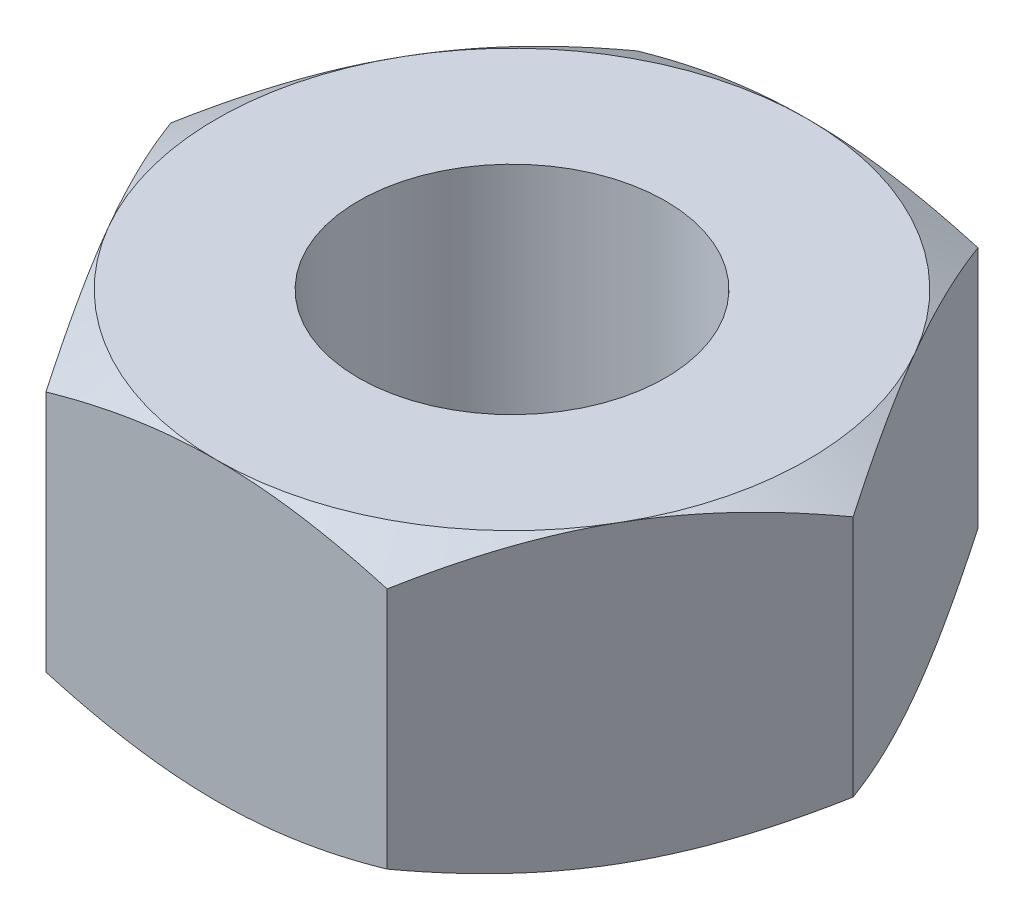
ISO-10303-21;
HEADER;
FILE_DESCRIPTION(('STEP AP214'),'2;1');
FILE_NAME('part.step','',(''),(''),'','','');
FILE_SCHEMA(('AUTOMOTIVE_DESIGN { 1 0 10303 214 1 1 1 1 }'));
ENDSEC;
DATA;
#1=APPLICATION_CONTEXT('core data for automotive mechanical design processes');
#2=APPLICATION_PROTOCOL_DEFINITION('international standard','automotive_design',2000,#1);
#3=PRODUCT_CONTEXT('',#1,'mechanical');
#4=PRODUCT('Part','Part','',(#3));
#5=PRODUCT_RELATED_PRODUCT_CATEGORY('part','',(#4));
#6=PRODUCT_DEFINITION_FORMATION('','',#4);
#7=PRODUCT_DEFINITION_CONTEXT('part definition',#1,'design');
#8=PRODUCT_DEFINITION('design','',#6,#7);
#9=PRODUCT_DEFINITION_SHAPE('','',#8);
#10=(LENGTH_UNIT() NAMED_UNIT(*) SI_UNIT(.MILLI.,.METRE.));
#11=(NAMED_UNIT(*) PLANE_ANGLE_UNIT() SI_UNIT($,.RADIAN.));
#12=(NAMED_UNIT(*) SI_UNIT($,.STERADIAN.) SOLID_ANGLE_UNIT());
#13=UNCERTAINTY_MEASURE_WITH_UNIT(LENGTH_MEASURE(1.E-05),#10,'distance_accuracy_value','');
#14=(GEOMETRIC_REPRESENTATION_CONTEXT(3) GLOBAL_UNCERTAINTY_ASSIGNED_CONTEXT((#13)) GLOBAL_UNIT_ASSIGNED_CONTEXT((#10,
#11,#12)) REPRESENTATION_CONTEXT('',''));
#15=CARTESIAN_POINT('',(0.,0.,0.));
#16=DIRECTION('',(0.,0.,1.));
#17=DIRECTION('',(1.,0.,0.));
#18=AXIS2_PLACEMENT_3D('',#15,#16,#17);
#19=CARTESIAN_POINT('',(3.75277674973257,3.25,6.5));
#20=DIRECTION('',(-0.866025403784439,0.,-0.5));
#21=DIRECTION('',(-0.5,0.,0.866025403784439));
#22=AXIS2_PLACEMENT_3D('',#19,#20,#21);
#23=PLANE('',#22);
#24=CARTESIAN_POINT('',(7.50566896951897,-2.66937674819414,-0.000200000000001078));
#25=CARTESIAN_POINT('',(7.4231786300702,-2.71699557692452,0.142677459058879));
#26=CARTESIAN_POINT('',(7.34038072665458,-2.7624532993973,0.286087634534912));
#27=CARTESIAN_POINT('',(7.17411251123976,-2.84845131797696,0.574072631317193));
#28=CARTESIAN_POINT('',(7.09064192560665,-2.88898949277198,0.718647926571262));
#29=CARTESIAN_POINT('',(6.83889369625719,-3.00242899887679,1.15468865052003));
#30=CARTESIAN_POINT('',(6.66962231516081,-3.06695219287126,1.44787528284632));
#31=CARTESIAN_POINT('',(6.41631077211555,-3.14261341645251,1.88662374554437));
#32=CARTESIAN_POINT('',(6.33302748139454,-3.16416714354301,2.03087463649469));
#33=CARTESIAN_POINT('',(6.16608458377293,-3.20030968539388,2.32002821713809));
#34=CARTESIAN_POINT('',(6.08242501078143,-3.21489911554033,2.46493084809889));
#35=CARTESIAN_POINT('',(5.91496056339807,-3.23674124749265,2.75498777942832));
#36=CARTESIAN_POINT('',(5.8311559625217,-3.24400227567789,2.90014160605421));
#37=CARTESIAN_POINT('',(5.66347396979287,-3.25103969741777,3.19057533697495));
#38=CARTESIAN_POINT('',(5.5795965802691,-3.25081632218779,3.33585523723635));
#39=CARTESIAN_POINT('',(5.34979921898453,-3.23991654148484,3.73387594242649));
#40=CARTESIAN_POINT('',(5.20395446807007,-3.22161818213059,3.98648646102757));
#41=CARTESIAN_POINT('',(4.91323365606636,-3.16359365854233,4.49002967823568));
#42=CARTESIAN_POINT('',(4.76835861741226,-3.12384766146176,4.74096060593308));
#43=CARTESIAN_POINT('',(4.47705272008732,-3.02449409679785,5.24551722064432));
#44=CARTESIAN_POINT('',(4.33065861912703,-2.96446557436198,5.49907924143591));
#45=CARTESIAN_POINT('',(4.04005357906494,-2.82822500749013,6.00242193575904));
#46=CARTESIAN_POINT('',(3.89583891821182,-2.75204496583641,6.25220905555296));
#47=CARTESIAN_POINT('',(3.75266127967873,-2.66937674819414,6.5002));
#48=B_SPLINE_CURVE_WITH_KNOTS('',3,(#24,#25,#26,#27,#28,#29,#30,#31,#32,#33,#34,#35,#36,#37,#38,
#39,#40,#41,#42,#43,#44,#45,#46,#47),.UNSPECIFIED.,.F.,.F.,(4,2,2,2,2,2,2,2,2,2,2,4),(0.,
0.515105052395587,1.03043143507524,2.06322554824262,2.56697389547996,3.07067772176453,
3.57380860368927,4.0769239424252,4.9527935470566,5.82947446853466,6.72559912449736,
7.61996451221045),.UNSPECIFIED.);
#49=CARTESIAN_POINT('',(7.50555349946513,-2.66944341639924,0.));
#50=VERTEX_POINT('',#49);
#51=CARTESIAN_POINT('',(5.62916512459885,-3.25,3.25));
#52=VERTEX_POINT('',#51);
#53=EDGE_CURVE('E47',#50,#52,#48,.T.);
#54=ORIENTED_EDGE('',*,*,#53,.F.);
#55=DIRECTION('',(0.,-1.,0.));
#56=VECTOR('',#55,1.);
#57=CARTESIAN_POINT('',(7.50555349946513,3.25,0.));
#58=LINE('',#57,#56);
#59=CARTESIAN_POINT('',(7.50555349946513,2.66944341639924,0.));
#60=VERTEX_POINT('',#59);
#61=EDGE_CURVE('E163',#60,#50,#58,.T.);
#62=ORIENTED_EDGE('',*,*,#61,.F.);
#63=CARTESIAN_POINT('',(3.75266127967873,2.66937674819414,6.5002));
#64=CARTESIAN_POINT('',(3.8351516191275,2.71699557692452,6.35732254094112));
#65=CARTESIAN_POINT('',(3.91794952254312,2.7624532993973,6.21391236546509));
#66=CARTESIAN_POINT('',(4.08421773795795,2.84845131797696,5.92592736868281));
#67=CARTESIAN_POINT('',(4.16768832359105,2.88898949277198,5.78135207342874));
#68=CARTESIAN_POINT('',(4.41943655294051,3.00242899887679,5.34531134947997));
#69=CARTESIAN_POINT('',(4.58870793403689,3.06695219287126,5.05212471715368));
#70=CARTESIAN_POINT('',(4.84201947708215,3.14261341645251,4.61337625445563));
#71=CARTESIAN_POINT('',(4.92530276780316,3.16416714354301,4.46912536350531));
#72=CARTESIAN_POINT('',(5.09224566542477,3.20030968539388,4.17997178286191));
#73=CARTESIAN_POINT('',(5.17590523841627,3.21489911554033,4.03506915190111));
#74=CARTESIAN_POINT('',(5.34336968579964,3.23674124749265,3.74501222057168));
#75=CARTESIAN_POINT('',(5.427174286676,3.24400227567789,3.59985839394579));
#76=CARTESIAN_POINT('',(5.59485627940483,3.25103969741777,3.30942466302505));
#77=CARTESIAN_POINT('',(5.6787336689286,3.25081632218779,3.16414476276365));
#78=CARTESIAN_POINT('',(5.90853103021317,3.23991654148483,2.76612405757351));
#79=CARTESIAN_POINT('',(6.05437578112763,3.22161818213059,2.51351353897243));
#80=CARTESIAN_POINT('',(6.34509659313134,3.16359365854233,2.00997032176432));
#81=CARTESIAN_POINT('',(6.48997163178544,3.12384766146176,1.75903939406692));
#82=CARTESIAN_POINT('',(6.78127752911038,3.02449409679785,1.25448277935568));
#83=CARTESIAN_POINT('',(6.92767163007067,2.96446557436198,1.00092075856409));
#84=CARTESIAN_POINT('',(7.21827667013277,2.82822500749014,0.497578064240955));
#85=CARTESIAN_POINT('',(7.36249133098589,2.75204496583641,0.247790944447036));
#86=CARTESIAN_POINT('',(7.50566896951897,2.66937674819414,-0.000200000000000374));
#87=B_SPLINE_CURVE_WITH_KNOTS('',3,(#63,#64,#65,#66,#67,#68,#69,#70,#71,#72,#73,#74,#75,#76,#77,
#78,#79,#80,#81,#82,#83,#84,#85,#86),.UNSPECIFIED.,.F.,.F.,(4,2,2,2,2,2,2,2,2,2,2,4),(0.,
0.515105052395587,1.03043143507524,2.06322554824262,2.56697389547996,3.07067772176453,
3.57380860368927,4.07692394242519,4.9527935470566,5.82947446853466,6.72559912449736,
7.61996451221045),.UNSPECIFIED.);
#88=CARTESIAN_POINT('',(5.62916512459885,3.25,3.25));
#89=VERTEX_POINT('',#88);
#90=EDGE_CURVE('E246',#89,#60,#87,.T.);
#91=ORIENTED_EDGE('',*,*,#90,.F.);
#92=CARTESIAN_POINT('',(3.75277674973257,2.66944341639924,6.5));
#93=VERTEX_POINT('',#92);
#94=EDGE_CURVE('E256',#93,#89,#87,.T.);
#95=ORIENTED_EDGE('',*,*,#94,.F.);
#96=DIRECTION('',(0.,-1.,0.));
#97=VECTOR('',#96,1.);
#98=CARTESIAN_POINT('',(3.75277674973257,3.25,6.5));
#99=LINE('',#98,#97);
#100=CARTESIAN_POINT('',(3.75277674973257,-2.66944341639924,6.5));
#101=VERTEX_POINT('',#100);
#102=EDGE_CURVE('E150',#93,#101,#99,.T.);
#103=ORIENTED_EDGE('',*,*,#102,.T.);
#104=EDGE_CURVE('E142',#52,#101,#48,.T.);
#105=ORIENTED_EDGE('',*,*,#104,.F.);
#106=EDGE_LOOP('',(#54,#62,#91,#95,#103,#105));
#107=FACE_BOUND('',#106,.T.);
#108=ADVANCED_FACE('F31',(#107),#23,.F.);
#109=CARTESIAN_POINT('',(7.50555349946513,3.25,0.));
#110=DIRECTION('',(-0.866025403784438,0.,0.5));
#111=DIRECTION('',(0.5,0.,0.866025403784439));
#112=AXIS2_PLACEMENT_3D('',#109,#110,#111);
#113=PLANE('',#112);
#114=CARTESIAN_POINT('',(3.75266127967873,-2.66937674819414,-6.5002));
#115=CARTESIAN_POINT('',(3.8351516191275,-2.71699557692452,-6.35732254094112));
#116=CARTESIAN_POINT('',(3.91794952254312,-2.7624532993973,-6.21391236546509));
#117=CARTESIAN_POINT('',(4.08421773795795,-2.84845131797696,-5.9259273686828));
#118=CARTESIAN_POINT('',(4.16768832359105,-2.88898949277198,-5.78135207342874));
#119=CARTESIAN_POINT('',(4.41943655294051,-3.00242899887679,-5.34531134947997));
#120=CARTESIAN_POINT('',(4.58870793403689,-3.06695219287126,-5.05212471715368));
#121=CARTESIAN_POINT('',(4.84201947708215,-3.14261341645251,-4.61337625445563));
#122=CARTESIAN_POINT('',(4.92530276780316,-3.16416714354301,-4.46912536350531));
#123=CARTESIAN_POINT('',(5.09224566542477,-3.20030968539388,-4.17997178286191));
#124=CARTESIAN_POINT('',(5.17590523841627,-3.21489911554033,-4.03506915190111));
#125=CARTESIAN_POINT('',(5.34336968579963,-3.23674124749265,-3.74501222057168));
#126=CARTESIAN_POINT('',(5.427174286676,-3.24400227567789,-3.59985839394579));
#127=CARTESIAN_POINT('',(5.59485627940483,-3.25103969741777,-3.30942466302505));
#128=CARTESIAN_POINT('',(5.6787336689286,-3.2508163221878,-3.16414476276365));
#129=CARTESIAN_POINT('',(5.90853103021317,-3.23991654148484,-2.76612405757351));
#130=CARTESIAN_POINT('',(6.05437578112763,-3.22161818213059,-2.51351353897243));
#131=CARTESIAN_POINT('',(6.34509659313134,-3.16359365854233,-2.00997032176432));
#132=CARTESIAN_POINT('',(6.48997163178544,-3.12384766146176,-1.75903939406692));
#133=CARTESIAN_POINT('',(6.78127752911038,-3.02449409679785,-1.25448277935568));
#134=CARTESIAN_POINT('',(6.92767163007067,-2.96446557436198,-1.00092075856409));
#135=CARTESIAN_POINT('',(7.21827667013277,-2.82822500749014,-0.497578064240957));
#136=CARTESIAN_POINT('',(7.36249133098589,-2.75204496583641,-0.247790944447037));
#137=CARTESIAN_POINT('',(7.50566896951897,-2.66937674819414,0.000199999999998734));
#138=B_SPLINE_CURVE_WITH_KNOTS('',3,(#114,#115,#116,#117,#118,#119,#120,#121,#122,#123,#124,
#125,#126,#127,#128,#129,#130,#131,#132,#133,#134,#135,#136,#137),.UNSPECIFIED.,.F.,.F.,(4,2,2,
2,2,2,2,2,2,2,2,4),(0.,0.515105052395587,1.03043143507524,2.06322554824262,2.56697389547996,
3.07067772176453,3.57380860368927,4.07692394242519,4.9527935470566,5.82947446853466,
6.72559912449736,7.61996451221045),.UNSPECIFIED.);
#139=CARTESIAN_POINT('',(3.75277674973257,-2.66944341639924,-6.5));
#140=VERTEX_POINT('',#139);
#141=CARTESIAN_POINT('',(5.62916512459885,-3.25,-3.25));
#142=VERTEX_POINT('',#141);
#143=EDGE_CURVE('E54',#140,#142,#138,.T.);
#144=ORIENTED_EDGE('',*,*,#143,.F.);
#145=DIRECTION('',(0.,-1.,0.));
#146=VECTOR('',#145,1.);
#147=CARTESIAN_POINT('',(3.75277674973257,3.25,-6.5));
#148=LINE('',#147,#146);
#149=CARTESIAN_POINT('',(3.75277674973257,2.66944341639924,-6.5));
#150=VERTEX_POINT('',#149);
#151=EDGE_CURVE('E160',#150,#140,#148,.T.);
#152=ORIENTED_EDGE('',*,*,#151,.F.);
#153=CARTESIAN_POINT('',(7.50566896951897,2.66937674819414,0.000199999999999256));
#154=CARTESIAN_POINT('',(7.4231786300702,2.71699557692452,-0.142677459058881));
#155=CARTESIAN_POINT('',(7.34038072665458,2.7624532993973,-0.286087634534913));
#156=CARTESIAN_POINT('',(7.17411251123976,2.84845131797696,-0.574072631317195));
#157=CARTESIAN_POINT('',(7.09064192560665,2.88898949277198,-0.718647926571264));
#158=CARTESIAN_POINT('',(6.83889369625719,3.00242899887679,-1.15468865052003));
#159=CARTESIAN_POINT('',(6.66962231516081,3.06695219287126,-1.44787528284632));
#160=CARTESIAN_POINT('',(6.41631077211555,3.14261341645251,-1.88662374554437));
#161=CARTESIAN_POINT('',(6.33302748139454,3.16416714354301,-2.03087463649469));
#162=CARTESIAN_POINT('',(6.16608458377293,3.20030968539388,-2.32002821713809));
#163=CARTESIAN_POINT('',(6.08242501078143,3.21489911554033,-2.46493084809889));
#164=CARTESIAN_POINT('',(5.91496056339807,3.23674124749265,-2.75498777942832));
#165=CARTESIAN_POINT('',(5.8311559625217,3.24400227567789,-2.90014160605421));
#166=CARTESIAN_POINT('',(5.66347396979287,3.25103969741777,-3.19057533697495));
#167=CARTESIAN_POINT('',(5.5795965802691,3.25081632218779,-3.33585523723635));
#168=CARTESIAN_POINT('',(5.34979921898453,3.23991654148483,-3.73387594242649));
#169=CARTESIAN_POINT('',(5.20395446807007,3.22161818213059,-3.98648646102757));
#170=CARTESIAN_POINT('',(4.91323365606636,3.16359365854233,-4.49002967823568));
#171=CARTESIAN_POINT('',(4.76835861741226,3.12384766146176,-4.74096060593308));
#172=CARTESIAN_POINT('',(4.47705272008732,3.02449409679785,-5.24551722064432));
#173=CARTESIAN_POINT('',(4.33065861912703,2.96446557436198,-5.49907924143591));
#174=CARTESIAN_POINT('',(4.04005357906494,2.82822500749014,-6.00242193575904));
#175=CARTESIAN_POINT('',(3.89583891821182,2.75204496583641,-6.25220905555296));
#176=CARTESIAN_POINT('',(3.75266127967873,2.66937674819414,-6.5002));
#177=B_SPLINE_CURVE_WITH_KNOTS('',3,(#153,#154,#155,#156,#157,#158,#159,#160,#161,#162,#163,
#164,#165,#166,#167,#168,#169,#170,#171,#172,#173,#174,#175,#176),.UNSPECIFIED.,.F.,.F.,(4,2,2,
2,2,2,2,2,2,2,2,4),(0.,0.515105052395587,1.03043143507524,2.06322554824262,2.56697389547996,
3.07067772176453,3.57380860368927,4.07692394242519,4.9527935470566,5.82947446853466,
6.72559912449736,7.61996451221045),.UNSPECIFIED.);
#178=CARTESIAN_POINT('',(5.62916512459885,3.25,-3.25));
#179=VERTEX_POINT('',#178);
#180=EDGE_CURVE('E255',#179,#150,#177,.T.);
#181=ORIENTED_EDGE('',*,*,#180,.F.);
#182=EDGE_CURVE('E251',#60,#179,#177,.T.);
#183=ORIENTED_EDGE('',*,*,#182,.F.);
#184=ORIENTED_EDGE('',*,*,#61,.T.);
#185=EDGE_CURVE('E268',#142,#50,#138,.T.);
#186=ORIENTED_EDGE('',*,*,#185,.F.);
#187=EDGE_LOOP('',(#144,#152,#181,#183,#184,#186));
#188=FACE_BOUND('',#187,.T.);
#189=ADVANCED_FACE('F257',(#188),#113,.F.);
#190=CARTESIAN_POINT('',(3.75277674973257,3.25,-6.5));
#191=DIRECTION('',(0.,0.,1.));
#192=DIRECTION('',(1.,0.,0.));
#193=AXIS2_PLACEMENT_3D('',#190,#191,#192);
#194=PLANE('',#193);
#195=CARTESIAN_POINT('',(-10.1135208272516,-0.0617560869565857,-6.5));
#196=CARTESIAN_POINT('',(-9.82935034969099,-0.199737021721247,-6.5));
#197=CARTESIAN_POINT('',(-9.54453109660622,-0.336404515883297,-6.5));
#198=CARTESIAN_POINT('',(-8.97325017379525,-0.606374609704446,-6.5));
#199=CARTESIAN_POINT('',(-8.68678825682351,-0.739676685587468,-6.5));
#200=CARTESIAN_POINT('',(-8.11041696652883,-1.00284152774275,-6.5));
#201=CARTESIAN_POINT('',(-7.82049733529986,-1.13268190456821,-6.5));
#202=CARTESIAN_POINT('',(-7.23836377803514,-1.3870934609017,-6.5));
#203=CARTESIAN_POINT('',(-6.94614996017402,-1.51166488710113,-6.5));
#204=CARTESIAN_POINT('',(-6.34939053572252,-1.75810187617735,-6.5));
#205=CARTESIAN_POINT('',(-6.0447533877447,-1.87974696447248,-6.5));
#206=CARTESIAN_POINT('',(-5.43192693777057,-2.11391042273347,-6.5));
#207=CARTESIAN_POINT('',(-5.12373724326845,-2.22642777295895,-6.5));
#208=CARTESIAN_POINT('',(-4.5038828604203,-2.43940644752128,-6.5));
#209=CARTESIAN_POINT('',(-4.1922265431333,-2.53989189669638,-6.5));
#210=CARTESIAN_POINT('',(-3.56443984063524,-2.72560299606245,-6.5));
#211=CARTESIAN_POINT('',(-3.24831088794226,-2.81083341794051,-6.5));
#212=CARTESIAN_POINT('',(-2.61318438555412,-2.96151245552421,-6.5));
#213=CARTESIAN_POINT('',(-2.29421310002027,-3.02707001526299,-6.5));
#214=CARTESIAN_POINT('',(-1.6522238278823,-3.13470964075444,-6.5));
#215=CARTESIAN_POINT('',(-1.32920623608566,-3.17679397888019,-6.5));
#216=CARTESIAN_POINT('',(-0.845079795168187,-3.21952256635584,-6.5));
#217=CARTESIAN_POINT('',(-0.684830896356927,-3.23035981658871,-6.5));
#218=CARTESIAN_POINT('',(-0.364011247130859,-3.24525189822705,-6.5));
#219=CARTESIAN_POINT('',(-0.20344050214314,-3.24930684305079,-6.5));
#220=CARTESIAN_POINT('',(0.117726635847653,-3.25053001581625,-6.5));
#221=CARTESIAN_POINT('',(0.278323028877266,-3.24769823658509,-6.5));
#222=CARTESIAN_POINT('',(0.599253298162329,-3.23521963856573,-6.5));
#223=CARTESIAN_POINT('',(0.759587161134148,-3.22557248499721,-6.5));
#224=CARTESIAN_POINT('',(1.14392607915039,-3.19448274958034,-6.5));
#225=CARTESIAN_POINT('',(1.36767946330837,-3.16986134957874,-6.5));
#226=CARTESIAN_POINT('',(1.81353669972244,-3.1086803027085,-6.5));
#227=CARTESIAN_POINT('',(2.03564032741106,-3.07211905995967,-6.5));
#228=CARTESIAN_POINT('',(2.69921711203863,-2.94646317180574,-6.5));
#229=CARTESIAN_POINT('',(3.13771059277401,-2.84141887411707,-6.5));
#230=CARTESIAN_POINT('',(3.79339853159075,-2.65912052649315,-6.5));
#231=CARTESIAN_POINT('',(4.01399055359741,-2.59338257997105,-6.5));
#232=CARTESIAN_POINT('',(4.45303253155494,-2.45504191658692,-6.5));
#233=CARTESIAN_POINT('',(4.67148247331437,-2.38243915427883,-6.5));
#234=CARTESIAN_POINT('',(5.10630803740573,-2.23153678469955,-6.5));
#235=CARTESIAN_POINT('',(5.32268430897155,-2.15323903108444,-6.5));
#236=CARTESIAN_POINT('',(5.75364187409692,-1.9918715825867,-6.5));
#237=CARTESIAN_POINT('',(5.96822318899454,-1.90880194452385,-6.5));
#238=CARTESIAN_POINT('',(6.47567680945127,-1.70689655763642,-6.5));
#239=CARTESIAN_POINT('',(6.76784492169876,-1.58629419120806,-6.5));
#240=CARTESIAN_POINT('',(7.349678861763,-1.3391799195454,-6.5));
#241=CARTESIAN_POINT('',(7.63934453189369,-1.21266764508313,-6.5));
#242=CARTESIAN_POINT('',(8.21663477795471,-0.954923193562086,-6.5));
#243=CARTESIAN_POINT('',(8.50425891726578,-0.823690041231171,-6.5));
#244=CARTESIAN_POINT('',(9.07775904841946,-0.557451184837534,-6.5));
#245=CARTESIAN_POINT('',(9.36363500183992,-0.422445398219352,-6.5));
#246=CARTESIAN_POINT('',(9.93423055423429,-0.149225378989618,-6.5));
#247=CARTESIAN_POINT('',(10.2189485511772,-0.0110078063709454,-6.5));
#248=CARTESIAN_POINT('',(10.7871485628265,0.267947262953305,-6.5));
#249=CARTESIAN_POINT('',(11.0706305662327,0.408684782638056,-6.5));
#250=CARTESIAN_POINT('',(11.9194411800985,0.833966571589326,-6.5));
#251=CARTESIAN_POINT('',(12.4832128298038,1.12161794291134,-6.5));
#252=CARTESIAN_POINT('',(13.5602729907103,1.67821105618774,-6.5));
#253=CARTESIAN_POINT('',(14.0738056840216,1.94668241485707,-6.5));
#254=CARTESIAN_POINT('',(15.0989534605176,2.48730381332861,-6.5));
#255=CARTESIAN_POINT('',(15.6105684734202,2.75945398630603,-6.5));
#256=CARTESIAN_POINT('',(16.6310038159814,3.30585849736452,-6.5));
#257=CARTESIAN_POINT('',(17.1398279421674,3.58010575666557,-6.5));
#258=CARTESIAN_POINT('',(18.1562506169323,4.13079503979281,-6.5));
#259=CARTESIAN_POINT('',(18.6638492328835,4.40723693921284,-6.5));
#260=CARTESIAN_POINT('',(19.1709972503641,4.6844974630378,-6.5));
#261=B_SPLINE_CURVE_WITH_KNOTS('',3,(#195,#196,#197,#198,#199,#200,#201,#202,#203,#204,#205,
#206,#207,#208,#209,#210,#211,#212,#213,#214,#215,#216,#217,#218,#219,#220,#221,#222,#223,#224,
#225,#226,#227,#228,#229,#230,#231,#232,#233,#234,#235,#236,#237,#238,#239,#240,#241,#242,#243,
#244,#245,#246,#247,#248,#249,#250,#251,#252,#253,#254,#255,#256,#257,#258,#259,#260),
.UNSPECIFIED.,.F.,.F.,(4,2,2,2,2,2,2,2,2,2,2,2,2,2,2,2,2,2,2,2,2,2,2,2,2,2,2,2,2,2,2,2,4),(0.,
0.947705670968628,1.89555793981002,2.84851502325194,3.80142743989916,4.78539370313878,
5.76946974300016,6.75153836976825,7.73329927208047,8.70951856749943,9.68564334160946,
10.1673664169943,10.6490814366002,11.1307969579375,11.6125361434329,12.2874673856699,
12.9624888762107,14.3132683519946,15.0037467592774,15.6942297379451,16.384488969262,
17.0747399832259,18.022894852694,18.9711090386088,19.9195202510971,20.8679522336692,
21.8174190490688,22.7668945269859,24.6655842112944,26.4039970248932,28.1424729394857,
29.8765439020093,31.6105172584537),.UNSPECIFIED.);
#262=CARTESIAN_POINT('',(-3.75277674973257,-2.66944341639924,-6.5));
#263=VERTEX_POINT('',#262);
#264=CARTESIAN_POINT('',(0.,-3.25,-6.5));
#265=VERTEX_POINT('',#264);
#266=EDGE_CURVE('E270',#263,#265,#261,.T.);
#267=ORIENTED_EDGE('',*,*,#266,.F.);
#268=DIRECTION('',(0.,-1.,0.));
#269=VECTOR('',#268,1.);
#270=CARTESIAN_POINT('',(-3.75277674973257,3.25,-6.5));
#271=LINE('',#270,#269);
#272=CARTESIAN_POINT('',(-3.75277674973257,2.66944341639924,-6.5));
#273=VERTEX_POINT('',#272);
#274=EDGE_CURVE('E152',#273,#263,#271,.T.);
#275=ORIENTED_EDGE('',*,*,#274,.F.);
#276=CARTESIAN_POINT('',(-10.1135208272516,0.0617560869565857,-6.5));
#277=CARTESIAN_POINT('',(-9.82935034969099,0.199737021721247,-6.5));
#278=CARTESIAN_POINT('',(-9.54453109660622,0.336404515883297,-6.5));
#279=CARTESIAN_POINT('',(-8.97325017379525,0.606374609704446,-6.5));
#280=CARTESIAN_POINT('',(-8.68678825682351,0.739676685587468,-6.5));
#281=CARTESIAN_POINT('',(-8.11041696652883,1.00284152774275,-6.5));
#282=CARTESIAN_POINT('',(-7.82049733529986,1.13268190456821,-6.5));
#283=CARTESIAN_POINT('',(-7.23836377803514,1.3870934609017,-6.5));
#284=CARTESIAN_POINT('',(-6.94614996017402,1.51166488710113,-6.5));
#285=CARTESIAN_POINT('',(-6.34939053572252,1.75810187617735,-6.5));
#286=CARTESIAN_POINT('',(-6.0447533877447,1.87974696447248,-6.5));
#287=CARTESIAN_POINT('',(-5.43192693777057,2.11391042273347,-6.5));
#288=CARTESIAN_POINT('',(-5.12373724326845,2.22642777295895,-6.5));
#289=CARTESIAN_POINT('',(-4.5038828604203,2.43940644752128,-6.5));
#290=CARTESIAN_POINT('',(-4.1922265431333,2.53989189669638,-6.5));
#291=CARTESIAN_POINT('',(-3.56443984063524,2.72560299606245,-6.5));
#292=CARTESIAN_POINT('',(-3.24831088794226,2.81083341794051,-6.5));
#293=CARTESIAN_POINT('',(-2.61318438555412,2.96151245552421,-6.5));
#294=CARTESIAN_POINT('',(-2.29421310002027,3.02707001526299,-6.5));
#295=CARTESIAN_POINT('',(-1.6522238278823,3.13470964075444,-6.5));
#296=CARTESIAN_POINT('',(-1.32920623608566,3.17679397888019,-6.5));
#297=CARTESIAN_POINT('',(-0.845079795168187,3.21952256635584,-6.5));
#298=CARTESIAN_POINT('',(-0.684830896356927,3.23035981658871,-6.5));
#299=CARTESIAN_POINT('',(-0.364011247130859,3.24525189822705,-6.5));
#300=CARTESIAN_POINT('',(-0.20344050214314,3.24930684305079,-6.5));
#301=CARTESIAN_POINT('',(0.117726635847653,3.25053001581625,-6.5));
#302=CARTESIAN_POINT('',(0.278323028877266,3.24769823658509,-6.5));
#303=CARTESIAN_POINT('',(0.599253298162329,3.23521963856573,-6.5));
#304=CARTESIAN_POINT('',(0.759587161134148,3.22557248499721,-6.5));
#305=CARTESIAN_POINT('',(1.14392607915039,3.19448274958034,-6.5));
#306=CARTESIAN_POINT('',(1.36767946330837,3.16986134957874,-6.5));
#307=CARTESIAN_POINT('',(1.81353669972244,3.1086803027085,-6.5));
#308=CARTESIAN_POINT('',(2.03564032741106,3.07211905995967,-6.5));
#309=CARTESIAN_POINT('',(2.69921711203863,2.94646317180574,-6.5));
#310=CARTESIAN_POINT('',(3.13771059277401,2.84141887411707,-6.5));
#311=CARTESIAN_POINT('',(3.79339853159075,2.65912052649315,-6.5));
#312=CARTESIAN_POINT('',(4.01399055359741,2.59338257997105,-6.5));
#313=CARTESIAN_POINT('',(4.45303253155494,2.45504191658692,-6.5));
#314=CARTESIAN_POINT('',(4.67148247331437,2.38243915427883,-6.5));
#315=CARTESIAN_POINT('',(5.10630803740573,2.23153678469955,-6.5));
#316=CARTESIAN_POINT('',(5.32268430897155,2.15323903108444,-6.5));
#317=CARTESIAN_POINT('',(5.75364187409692,1.9918715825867,-6.5));
#318=CARTESIAN_POINT('',(5.96822318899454,1.90880194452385,-6.5));
#319=CARTESIAN_POINT('',(6.47567680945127,1.70689655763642,-6.5));
#320=CARTESIAN_POINT('',(6.76784492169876,1.58629419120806,-6.5));
#321=CARTESIAN_POINT('',(7.349678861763,1.3391799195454,-6.5));
#322=CARTESIAN_POINT('',(7.63934453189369,1.21266764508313,-6.5));
#323=CARTESIAN_POINT('',(8.21663477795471,0.954923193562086,-6.5));
#324=CARTESIAN_POINT('',(8.50425891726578,0.823690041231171,-6.5));
#325=CARTESIAN_POINT('',(9.07775904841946,0.557451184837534,-6.5));
#326=CARTESIAN_POINT('',(9.36363500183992,0.422445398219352,-6.5));
#327=CARTESIAN_POINT('',(9.93423055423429,0.149225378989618,-6.5));
#328=CARTESIAN_POINT('',(10.2189485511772,0.0110078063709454,-6.5));
#329=CARTESIAN_POINT('',(10.7871485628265,-0.267947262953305,-6.5));
#330=CARTESIAN_POINT('',(11.0706305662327,-0.408684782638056,-6.5));
#331=CARTESIAN_POINT('',(11.9194411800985,-0.833966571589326,-6.5));
#332=CARTESIAN_POINT('',(12.4832128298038,-1.12161794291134,-6.5));
#333=CARTESIAN_POINT('',(13.5602729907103,-1.67821105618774,-6.5));
#334=CARTESIAN_POINT('',(14.0738056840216,-1.94668241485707,-6.5));
#335=CARTESIAN_POINT('',(15.0989534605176,-2.48730381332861,-6.5));
#336=CARTESIAN_POINT('',(15.6105684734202,-2.75945398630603,-6.5));
#337=CARTESIAN_POINT('',(16.6310038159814,-3.30585849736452,-6.5));
#338=CARTESIAN_POINT('',(17.1398279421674,-3.58010575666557,-6.5));
#339=CARTESIAN_POINT('',(18.1562506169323,-4.13079503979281,-6.5));
#340=CARTESIAN_POINT('',(18.6638492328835,-4.40723693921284,-6.5));
#341=CARTESIAN_POINT('',(19.1709972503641,-4.6844974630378,-6.5));
#342=B_SPLINE_CURVE_WITH_KNOTS('',3,(#276,#277,#278,#279,#280,#281,#282,#283,#284,#285,#286,
#287,#288,#289,#290,#291,#292,#293,#294,#295,#296,#297,#298,#299,#300,#301,#302,#303,#304,#305,
#306,#307,#308,#309,#310,#311,#312,#313,#314,#315,#316,#317,#318,#319,#320,#321,#322,#323,#324,
#325,#326,#327,#328,#329,#330,#331,#332,#333,#334,#335,#336,#337,#338,#339,#340,#341),
.UNSPECIFIED.,.F.,.F.,(4,2,2,2,2,2,2,2,2,2,2,2,2,2,2,2,2,2,2,2,2,2,2,2,2,2,2,2,2,2,2,2,4),(0.,
0.947705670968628,1.89555793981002,2.84851502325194,3.80142743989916,4.78539370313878,
5.76946974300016,6.75153836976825,7.73329927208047,8.70951856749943,9.68564334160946,
10.1673664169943,10.6490814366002,11.1307969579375,11.6125361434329,12.2874673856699,
12.9624888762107,14.3132683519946,15.0037467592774,15.6942297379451,16.384488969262,
17.0747399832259,18.022894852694,18.9711090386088,19.9195202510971,20.8679522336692,
21.8174190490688,22.7668945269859,24.6655842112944,26.4039970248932,28.1424729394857,
29.8765439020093,31.6105172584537),.UNSPECIFIED.);
#343=CARTESIAN_POINT('',(0.,3.25,-6.5));
#344=VERTEX_POINT('',#343);
#345=EDGE_CURVE('E203',#344,#273,#342,.F.);
#346=ORIENTED_EDGE('',*,*,#345,.F.);
#347=EDGE_CURVE('E210',#150,#344,#342,.F.);
#348=ORIENTED_EDGE('',*,*,#347,.F.);
#349=ORIENTED_EDGE('',*,*,#151,.T.);
#350=EDGE_CURVE('E269',#265,#140,#261,.T.);
#351=ORIENTED_EDGE('',*,*,#350,.F.);
#352=EDGE_LOOP('',(#267,#275,#346,#348,#349,#351));
#353=FACE_BOUND('',#352,.T.);
#354=ADVANCED_FACE('F260',(#353),#194,.F.);
#355=CARTESIAN_POINT('',(-3.75277674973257,3.25,-6.5));
#356=DIRECTION('',(0.866025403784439,0.,0.5));
#357=DIRECTION('',(0.5,0.,-0.866025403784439));
#358=AXIS2_PLACEMENT_3D('',#355,#356,#357);
#359=PLANE('',#358);
#360=CARTESIAN_POINT('',(-7.50566896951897,-2.66937674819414,0.000200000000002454));
#361=CARTESIAN_POINT('',(-7.4231786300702,-2.71699557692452,-0.142677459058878));
#362=CARTESIAN_POINT('',(-7.34038072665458,-2.7624532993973,-0.28608763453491));
#363=CARTESIAN_POINT('',(-7.17411251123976,-2.84845131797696,-0.574072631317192));
#364=CARTESIAN_POINT('',(-7.09064192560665,-2.88898949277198,-0.718647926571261));
#365=CARTESIAN_POINT('',(-6.83889369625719,-3.00242899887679,-1.15468865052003));
#366=CARTESIAN_POINT('',(-6.66962231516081,-3.06695219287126,-1.44787528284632));
#367=CARTESIAN_POINT('',(-6.41631077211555,-3.14261341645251,-1.88662374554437));
#368=CARTESIAN_POINT('',(-6.33302748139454,-3.16416714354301,-2.03087463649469));
#369=CARTESIAN_POINT('',(-6.16608458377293,-3.20030968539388,-2.32002821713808));
#370=CARTESIAN_POINT('',(-6.08242501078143,-3.21489911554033,-2.46493084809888));
#371=CARTESIAN_POINT('',(-5.91496056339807,-3.23674124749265,-2.75498777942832));
#372=CARTESIAN_POINT('',(-5.8311559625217,-3.24400227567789,-2.90014160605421));
#373=CARTESIAN_POINT('',(-5.66347396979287,-3.25103969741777,-3.19057533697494));
#374=CARTESIAN_POINT('',(-5.5795965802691,-3.2508163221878,-3.33585523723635));
#375=CARTESIAN_POINT('',(-5.34979921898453,-3.23991654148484,-3.73387594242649));
#376=CARTESIAN_POINT('',(-5.20395446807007,-3.22161818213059,-3.98648646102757));
#377=CARTESIAN_POINT('',(-4.91323365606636,-3.16359365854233,-4.49002967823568));
#378=CARTESIAN_POINT('',(-4.76835861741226,-3.12384766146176,-4.74096060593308));
#379=CARTESIAN_POINT('',(-4.47705272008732,-3.02449409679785,-5.24551722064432));
#380=CARTESIAN_POINT('',(-4.33065861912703,-2.96446557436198,-5.49907924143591));
#381=CARTESIAN_POINT('',(-4.04005357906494,-2.82822500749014,-6.00242193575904));
#382=CARTESIAN_POINT('',(-3.89583891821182,-2.75204496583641,-6.25220905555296));
#383=CARTESIAN_POINT('',(-3.75266127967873,-2.66937674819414,-6.5002));
#384=B_SPLINE_CURVE_WITH_KNOTS('',3,(#360,#361,#362,#363,#364,#365,#366,#367,#368,#369,#370,
#371,#372,#373,#374,#375,#376,#377,#378,#379,#380,#381,#382,#383),.UNSPECIFIED.,.F.,.F.,(4,2,2,
2,2,2,2,2,2,2,2,4),(0.,0.515105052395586,1.03043143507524,2.06322554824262,2.56697389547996,
3.07067772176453,3.57380860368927,4.07692394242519,4.9527935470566,5.82947446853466,
6.72559912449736,7.61996451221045),.UNSPECIFIED.);
#385=CARTESIAN_POINT('',(-7.50555349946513,-2.66944341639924,0.));
#386=VERTEX_POINT('',#385);
#387=CARTESIAN_POINT('',(-5.62916512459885,-3.25,-3.25));
#388=VERTEX_POINT('',#387);
#389=EDGE_CURVE('E276',#386,#388,#384,.T.);
#390=ORIENTED_EDGE('',*,*,#389,.F.);
#391=DIRECTION('',(0.,-1.,0.));
#392=VECTOR('',#391,1.);
#393=CARTESIAN_POINT('',(-7.50555349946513,3.25,0.));
#394=LINE('',#393,#392);
#395=CARTESIAN_POINT('',(-7.50555349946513,2.66944341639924,0.));
#396=VERTEX_POINT('',#395);
#397=EDGE_CURVE('E149',#396,#386,#394,.T.);
#398=ORIENTED_EDGE('',*,*,#397,.F.);
#399=CARTESIAN_POINT('',(-3.75266127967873,2.66937674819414,-6.5002));
#400=CARTESIAN_POINT('',(-3.8351516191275,2.71699557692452,-6.35732254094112));
#401=CARTESIAN_POINT('',(-3.91794952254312,2.7624532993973,-6.21391236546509));
#402=CARTESIAN_POINT('',(-4.08421773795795,2.84845131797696,-5.9259273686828));
#403=CARTESIAN_POINT('',(-4.16768832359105,2.88898949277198,-5.78135207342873));
#404=CARTESIAN_POINT('',(-4.41943655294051,3.00242899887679,-5.34531134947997));
#405=CARTESIAN_POINT('',(-4.58870793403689,3.06695219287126,-5.05212471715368));
#406=CARTESIAN_POINT('',(-4.84201947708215,3.14261341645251,-4.61337625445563));
#407=CARTESIAN_POINT('',(-4.92530276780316,3.16416714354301,-4.46912536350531));
#408=CARTESIAN_POINT('',(-5.09224566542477,3.20030968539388,-4.17997178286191));
#409=CARTESIAN_POINT('',(-5.17590523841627,3.21489911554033,-4.03506915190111));
#410=CARTESIAN_POINT('',(-5.34336968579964,3.23674124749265,-3.74501222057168));
#411=CARTESIAN_POINT('',(-5.427174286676,3.24400227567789,-3.59985839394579));
#412=CARTESIAN_POINT('',(-5.59485627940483,3.25103969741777,-3.30942466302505));
#413=CARTESIAN_POINT('',(-5.6787336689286,3.25081632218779,-3.16414476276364));
#414=CARTESIAN_POINT('',(-5.90853103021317,3.23991654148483,-2.76612405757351));
#415=CARTESIAN_POINT('',(-6.05437578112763,3.22161818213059,-2.51351353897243));
#416=CARTESIAN_POINT('',(-6.34509659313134,3.16359365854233,-2.00997032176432));
#417=CARTESIAN_POINT('',(-6.48997163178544,3.12384766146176,-1.75903939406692));
#418=CARTESIAN_POINT('',(-6.78127752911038,3.02449409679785,-1.25448277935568));
#419=CARTESIAN_POINT('',(-6.92767163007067,2.96446557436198,-1.00092075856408));
#420=CARTESIAN_POINT('',(-7.21827667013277,2.82822500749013,-0.497578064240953));
#421=CARTESIAN_POINT('',(-7.36249133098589,2.75204496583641,-0.247790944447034));
#422=CARTESIAN_POINT('',(-7.50566896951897,2.66937674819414,0.000200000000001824));
#423=B_SPLINE_CURVE_WITH_KNOTS('',3,(#399,#400,#401,#402,#403,#404,#405,#406,#407,#408,#409,
#410,#411,#412,#413,#414,#415,#416,#417,#418,#419,#420,#421,#422),.UNSPECIFIED.,.F.,.F.,(4,2,2,
2,2,2,2,2,2,2,2,4),(0.,0.515105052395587,1.03043143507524,2.06322554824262,2.56697389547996,
3.07067772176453,3.57380860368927,4.07692394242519,4.9527935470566,5.82947446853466,
6.72559912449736,7.61996451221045),.UNSPECIFIED.);
#424=CARTESIAN_POINT('',(-5.62916512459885,3.25,-3.25));
#425=VERTEX_POINT('',#424);
#426=EDGE_CURVE('E193',#425,#396,#423,.T.);
#427=ORIENTED_EDGE('',*,*,#426,.F.);
#428=EDGE_CURVE('E196',#273,#425,#423,.T.);
#429=ORIENTED_EDGE('',*,*,#428,.F.);
#430=ORIENTED_EDGE('',*,*,#274,.T.);
#431=EDGE_CURVE('E275',#388,#263,#384,.T.);
#432=ORIENTED_EDGE('',*,*,#431,.F.);
#433=EDGE_LOOP('',(#390,#398,#427,#429,#430,#432));
#434=FACE_BOUND('',#433,.T.);
#435=ADVANCED_FACE('F195',(#434),#359,.F.);
#436=CARTESIAN_POINT('',(-7.50555349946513,3.25,0.));
#437=DIRECTION('',(0.866025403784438,0.,-0.5));
#438=DIRECTION('',(-0.5,0.,-0.866025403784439));
#439=AXIS2_PLACEMENT_3D('',#436,#437,#438);
#440=PLANE('',#439);
#441=CARTESIAN_POINT('',(-3.75266127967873,-2.66937674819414,6.5002));
#442=CARTESIAN_POINT('',(-3.8351516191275,-2.71699557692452,6.35732254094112));
#443=CARTESIAN_POINT('',(-3.91794952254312,-2.7624532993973,6.21391236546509));
#444=CARTESIAN_POINT('',(-4.08421773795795,-2.84845131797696,5.92592736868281));
#445=CARTESIAN_POINT('',(-4.16768832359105,-2.88898949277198,5.78135207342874));
#446=CARTESIAN_POINT('',(-4.41943655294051,-3.00242899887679,5.34531134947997));
#447=CARTESIAN_POINT('',(-4.58870793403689,-3.06695219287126,5.05212471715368));
#448=CARTESIAN_POINT('',(-4.84201947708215,-3.14261341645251,4.61337625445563));
#449=CARTESIAN_POINT('',(-4.92530276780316,-3.16416714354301,4.46912536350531));
#450=CARTESIAN_POINT('',(-5.09224566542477,-3.20030968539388,4.17997178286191));
#451=CARTESIAN_POINT('',(-5.17590523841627,-3.21489911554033,4.03506915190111));
#452=CARTESIAN_POINT('',(-5.34336968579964,-3.23674124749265,3.74501222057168));
#453=CARTESIAN_POINT('',(-5.427174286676,-3.24400227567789,3.59985839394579));
#454=CARTESIAN_POINT('',(-5.59485627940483,-3.25103969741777,3.30942466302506));
#455=CARTESIAN_POINT('',(-5.6787336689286,-3.25081632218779,3.16414476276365));
#456=CARTESIAN_POINT('',(-5.90853103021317,-3.23991654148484,2.76612405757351));
#457=CARTESIAN_POINT('',(-6.05437578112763,-3.22161818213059,2.51351353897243));
#458=CARTESIAN_POINT('',(-6.34509659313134,-3.16359365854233,2.00997032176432));
#459=CARTESIAN_POINT('',(-6.48997163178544,-3.12384766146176,1.75903939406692));
#460=CARTESIAN_POINT('',(-6.78127752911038,-3.02449409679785,1.25448277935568));
#461=CARTESIAN_POINT('',(-6.92767163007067,-2.96446557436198,1.00092075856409));
#462=CARTESIAN_POINT('',(-7.21827667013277,-2.82822500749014,0.497578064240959));
#463=CARTESIAN_POINT('',(-7.36249133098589,-2.75204496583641,0.24779094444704));
#464=CARTESIAN_POINT('',(-7.50566896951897,-2.66937674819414,-0.000199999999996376));
#465=B_SPLINE_CURVE_WITH_KNOTS('',3,(#441,#442,#443,#444,#445,#446,#447,#448,#449,#450,#451,
#452,#453,#454,#455,#456,#457,#458,#459,#460,#461,#462,#463,#464),.UNSPECIFIED.,.F.,.F.,(4,2,2,
2,2,2,2,2,2,2,2,4),(0.,0.515105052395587,1.03043143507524,2.06322554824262,2.56697389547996,
3.07067772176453,3.57380860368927,4.07692394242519,4.9527935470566,5.82947446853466,
6.72559912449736,7.61996451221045),.UNSPECIFIED.);
#466=CARTESIAN_POINT('',(-3.75277674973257,-2.66944341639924,6.5));
#467=VERTEX_POINT('',#466);
#468=CARTESIAN_POINT('',(-5.62916512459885,-3.25,3.25));
#469=VERTEX_POINT('',#468);
#470=EDGE_CURVE('E125',#467,#469,#465,.T.);
#471=ORIENTED_EDGE('',*,*,#470,.F.);
#472=DIRECTION('',(0.,-1.,0.));
#473=VECTOR('',#472,1.);
#474=CARTESIAN_POINT('',(-3.75277674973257,3.25,6.5));
#475=LINE('',#474,#473);
#476=CARTESIAN_POINT('',(-3.75277674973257,2.66944341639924,6.5));
#477=VERTEX_POINT('',#476);
#478=EDGE_CURVE('E139',#477,#467,#475,.T.);
#479=ORIENTED_EDGE('',*,*,#478,.F.);
#480=CARTESIAN_POINT('',(-7.50566896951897,2.66937674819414,-0.000199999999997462));
#481=CARTESIAN_POINT('',(-7.4231786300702,2.71699557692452,0.142677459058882));
#482=CARTESIAN_POINT('',(-7.34038072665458,2.7624532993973,0.286087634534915));
#483=CARTESIAN_POINT('',(-7.17411251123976,2.84845131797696,0.574072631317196));
#484=CARTESIAN_POINT('',(-7.09064192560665,2.88898949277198,0.718647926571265));
#485=CARTESIAN_POINT('',(-6.83889369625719,3.00242899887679,1.15468865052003));
#486=CARTESIAN_POINT('',(-6.66962231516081,3.06695219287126,1.44787528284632));
#487=CARTESIAN_POINT('',(-6.41631077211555,3.14261341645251,1.88662374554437));
#488=CARTESIAN_POINT('',(-6.33302748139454,3.16416714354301,2.03087463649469));
#489=CARTESIAN_POINT('',(-6.16608458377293,3.20030968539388,2.32002821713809));
#490=CARTESIAN_POINT('',(-6.08242501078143,3.21489911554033,2.46493084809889));
#491=CARTESIAN_POINT('',(-5.91496056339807,3.23674124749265,2.75498777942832));
#492=CARTESIAN_POINT('',(-5.8311559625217,3.24400227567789,2.90014160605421));
#493=CARTESIAN_POINT('',(-5.66347396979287,3.25103969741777,3.19057533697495));
#494=CARTESIAN_POINT('',(-5.5795965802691,3.25081632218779,3.33585523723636));
#495=CARTESIAN_POINT('',(-5.34979921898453,3.23991654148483,3.73387594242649));
#496=CARTESIAN_POINT('',(-5.20395446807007,3.22161818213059,3.98648646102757));
#497=CARTESIAN_POINT('',(-4.91323365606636,3.16359365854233,4.49002967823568));
#498=CARTESIAN_POINT('',(-4.76835861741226,3.12384766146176,4.74096060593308));
#499=CARTESIAN_POINT('',(-4.47705272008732,3.02449409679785,5.24551722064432));
#500=CARTESIAN_POINT('',(-4.33065861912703,2.96446557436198,5.49907924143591));
#501=CARTESIAN_POINT('',(-4.04005357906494,2.82822500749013,6.00242193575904));
#502=CARTESIAN_POINT('',(-3.89583891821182,2.75204496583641,6.25220905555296));
#503=CARTESIAN_POINT('',(-3.75266127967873,2.66937674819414,6.5002));
#504=B_SPLINE_CURVE_WITH_KNOTS('',3,(#480,#481,#482,#483,#484,#485,#486,#487,#488,#489,#490,
#491,#492,#493,#494,#495,#496,#497,#498,#499,#500,#501,#502,#503),.UNSPECIFIED.,.F.,.F.,(4,2,2,
2,2,2,2,2,2,2,2,4),(0.,0.515105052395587,1.03043143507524,2.06322554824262,2.56697389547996,
3.07067772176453,3.57380860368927,4.07692394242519,4.9527935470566,5.82947446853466,
6.72559912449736,7.61996451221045),.UNSPECIFIED.);
#505=CARTESIAN_POINT('',(-5.62916512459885,3.25,3.25));
#506=VERTEX_POINT('',#505);
#507=EDGE_CURVE('E202',#506,#477,#504,.T.);
#508=ORIENTED_EDGE('',*,*,#507,.F.);
#509=EDGE_CURVE('E200',#396,#506,#504,.T.);
#510=ORIENTED_EDGE('',*,*,#509,.F.);
#511=ORIENTED_EDGE('',*,*,#397,.T.);
#512=EDGE_CURVE('E141',#469,#386,#465,.T.);
#513=ORIENTED_EDGE('',*,*,#512,.F.);
#514=EDGE_LOOP('',(#471,#479,#508,#510,#511,#513));
#515=FACE_BOUND('',#514,.T.);
#516=ADVANCED_FACE('F137',(#515),#440,.F.);
#517=CARTESIAN_POINT('',(-3.75277674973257,3.25,6.5));
#518=DIRECTION('',(0.,0.,-1.));
#519=DIRECTION('',(-1.,0.,0.));
#520=AXIS2_PLACEMENT_3D('',#517,#518,#519);
#521=PLANE('',#520);
#522=CARTESIAN_POINT('',(-10.1135208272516,-0.061756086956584,6.5));
#523=CARTESIAN_POINT('',(-9.82935034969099,-0.199737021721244,6.5));
#524=CARTESIAN_POINT('',(-9.54453109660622,-0.336404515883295,6.5));
#525=CARTESIAN_POINT('',(-8.97325017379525,-0.606374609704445,6.5));
#526=CARTESIAN_POINT('',(-8.68678825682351,-0.739676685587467,6.5));
#527=CARTESIAN_POINT('',(-8.11041696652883,-1.00284152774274,6.5));
#528=CARTESIAN_POINT('',(-7.82049733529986,-1.13268190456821,6.5));
#529=CARTESIAN_POINT('',(-7.23836377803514,-1.3870934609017,6.5));
#530=CARTESIAN_POINT('',(-6.94614996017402,-1.51166488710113,6.5));
#531=CARTESIAN_POINT('',(-6.34939053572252,-1.75810187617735,6.5));
#532=CARTESIAN_POINT('',(-6.04475338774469,-1.87974696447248,6.5));
#533=CARTESIAN_POINT('',(-5.43192693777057,-2.11391042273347,6.5));
#534=CARTESIAN_POINT('',(-5.12373724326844,-2.22642777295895,6.5));
#535=CARTESIAN_POINT('',(-4.50388286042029,-2.43940644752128,6.5));
#536=CARTESIAN_POINT('',(-4.19222654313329,-2.53989189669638,6.5));
#537=CARTESIAN_POINT('',(-3.56443984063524,-2.72560299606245,6.5));
#538=CARTESIAN_POINT('',(-3.24831088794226,-2.81083341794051,6.5));
#539=CARTESIAN_POINT('',(-2.61318438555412,-2.96151245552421,6.5));
#540=CARTESIAN_POINT('',(-2.29421310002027,-3.02707001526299,6.5));
#541=CARTESIAN_POINT('',(-1.6522238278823,-3.13470964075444,6.5));
#542=CARTESIAN_POINT('',(-1.32920623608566,-3.17679397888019,6.5));
#543=CARTESIAN_POINT('',(-0.845079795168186,-3.21952256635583,6.5));
#544=CARTESIAN_POINT('',(-0.684830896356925,-3.23035981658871,6.5));
#545=CARTESIAN_POINT('',(-0.364011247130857,-3.24525189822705,6.5));
#546=CARTESIAN_POINT('',(-0.203440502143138,-3.24930684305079,6.5));
#547=CARTESIAN_POINT('',(0.117726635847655,-3.25053001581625,6.5));
#548=CARTESIAN_POINT('',(0.278323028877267,-3.24769823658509,6.5));
#549=CARTESIAN_POINT('',(0.59925329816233,-3.23521963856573,6.5));
#550=CARTESIAN_POINT('',(0.759587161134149,-3.22557248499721,6.5));
#551=CARTESIAN_POINT('',(1.14392607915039,-3.19448274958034,6.5));
#552=CARTESIAN_POINT('',(1.36767946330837,-3.16986134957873,6.5));
#553=CARTESIAN_POINT('',(1.81353669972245,-3.1086803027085,6.5));
#554=CARTESIAN_POINT('',(2.03564032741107,-3.07211905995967,6.5));
#555=CARTESIAN_POINT('',(2.69921711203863,-2.94646317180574,6.5));
#556=CARTESIAN_POINT('',(3.13771059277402,-2.84141887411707,6.5));
#557=CARTESIAN_POINT('',(3.79339853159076,-2.65912052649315,6.5));
#558=CARTESIAN_POINT('',(4.01399055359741,-2.59338257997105,6.5));
#559=CARTESIAN_POINT('',(4.45303253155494,-2.45504191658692,6.5));
#560=CARTESIAN_POINT('',(4.67148247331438,-2.38243915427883,6.5));
#561=CARTESIAN_POINT('',(5.10630803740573,-2.23153678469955,6.5));
#562=CARTESIAN_POINT('',(5.32268430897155,-2.15323903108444,6.5));
#563=CARTESIAN_POINT('',(5.75364187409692,-1.99187158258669,6.5));
#564=CARTESIAN_POINT('',(5.96822318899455,-1.90880194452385,6.5));
#565=CARTESIAN_POINT('',(6.47567680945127,-1.70689655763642,6.5));
#566=CARTESIAN_POINT('',(6.76784492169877,-1.58629419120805,6.5));
#567=CARTESIAN_POINT('',(7.349678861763,-1.3391799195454,6.5));
#568=CARTESIAN_POINT('',(7.63934453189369,-1.21266764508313,6.5));
#569=CARTESIAN_POINT('',(8.21663477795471,-0.954923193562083,6.5));
#570=CARTESIAN_POINT('',(8.50425891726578,-0.82369004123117,6.5));
#571=CARTESIAN_POINT('',(9.07775904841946,-0.557451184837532,6.5));
#572=CARTESIAN_POINT('',(9.36363500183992,-0.42244539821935,6.5));
#573=CARTESIAN_POINT('',(9.93423055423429,-0.149225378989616,6.5));
#574=CARTESIAN_POINT('',(10.2189485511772,-0.0110078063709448,6.5));
#575=CARTESIAN_POINT('',(10.7871485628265,0.267947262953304,6.5));
#576=CARTESIAN_POINT('',(11.0706305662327,0.408684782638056,6.5));
#577=CARTESIAN_POINT('',(11.9194411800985,0.833966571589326,6.5));
#578=CARTESIAN_POINT('',(12.4832128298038,1.12161794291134,6.5));
#579=CARTESIAN_POINT('',(13.5602729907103,1.67821105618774,6.5));
#580=CARTESIAN_POINT('',(14.0738056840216,1.94668241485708,6.5));
#581=CARTESIAN_POINT('',(15.0989534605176,2.48730381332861,6.5));
#582=CARTESIAN_POINT('',(15.6105684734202,2.75945398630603,6.5));
#583=CARTESIAN_POINT('',(16.6310038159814,3.30585849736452,6.5));
#584=CARTESIAN_POINT('',(17.1398279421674,3.58010575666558,6.5));
#585=CARTESIAN_POINT('',(18.1562506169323,4.13079503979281,6.5));
#586=CARTESIAN_POINT('',(18.6638492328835,4.40723693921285,6.5));
#587=CARTESIAN_POINT('',(19.1709972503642,4.6844974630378,6.5));
#588=B_SPLINE_CURVE_WITH_KNOTS('',3,(#522,#523,#524,#525,#526,#527,#528,#529,#530,#531,#532,
#533,#534,#535,#536,#537,#538,#539,#540,#541,#542,#543,#544,#545,#546,#547,#548,#549,#550,#551,
#552,#553,#554,#555,#556,#557,#558,#559,#560,#561,#562,#563,#564,#565,#566,#567,#568,#569,#570,
#571,#572,#573,#574,#575,#576,#577,#578,#579,#580,#581,#582,#583,#584,#585,#586,#587),
.UNSPECIFIED.,.F.,.F.,(4,2,2,2,2,2,2,2,2,2,2,2,2,2,2,2,2,2,2,2,2,2,2,2,2,2,2,2,2,2,2,2,4),(0.,
0.94770567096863,1.89555793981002,2.84851502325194,3.80142743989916,4.78539370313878,
5.76946974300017,6.75153836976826,7.73329927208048,8.70951856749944,9.68564334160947,
10.1673664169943,10.6490814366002,11.1307969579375,11.6125361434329,12.2874673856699,
12.9624888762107,14.3132683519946,15.0037467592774,15.6942297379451,16.384488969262,
17.0747399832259,18.022894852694,18.9711090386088,19.9195202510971,20.8679522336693,
21.8174190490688,22.7668945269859,24.6655842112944,26.4039970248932,28.1424729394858,
29.8765439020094,31.6105172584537),.UNSPECIFIED.);
#589=CARTESIAN_POINT('',(0.,-3.25,6.5));
#590=VERTEX_POINT('',#589);
#591=EDGE_CURVE('E133',#101,#590,#588,.F.);
#592=ORIENTED_EDGE('',*,*,#591,.F.);
#593=ORIENTED_EDGE('',*,*,#102,.F.);
#594=CARTESIAN_POINT('',(-10.1135208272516,0.061756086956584,6.5));
#595=CARTESIAN_POINT('',(-9.82935034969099,0.199737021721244,6.5));
#596=CARTESIAN_POINT('',(-9.54453109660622,0.336404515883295,6.5));
#597=CARTESIAN_POINT('',(-8.97325017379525,0.606374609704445,6.5));
#598=CARTESIAN_POINT('',(-8.68678825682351,0.739676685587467,6.5));
#599=CARTESIAN_POINT('',(-8.11041696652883,1.00284152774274,6.5));
#600=CARTESIAN_POINT('',(-7.82049733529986,1.13268190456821,6.5));
#601=CARTESIAN_POINT('',(-7.23836377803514,1.3870934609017,6.5));
#602=CARTESIAN_POINT('',(-6.94614996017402,1.51166488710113,6.5));
#603=CARTESIAN_POINT('',(-6.34939053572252,1.75810187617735,6.5));
#604=CARTESIAN_POINT('',(-6.04475338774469,1.87974696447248,6.5));
#605=CARTESIAN_POINT('',(-5.43192693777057,2.11391042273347,6.5));
#606=CARTESIAN_POINT('',(-5.12373724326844,2.22642777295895,6.5));
#607=CARTESIAN_POINT('',(-4.50388286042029,2.43940644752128,6.5));
#608=CARTESIAN_POINT('',(-4.19222654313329,2.53989189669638,6.5));
#609=CARTESIAN_POINT('',(-3.56443984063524,2.72560299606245,6.5));
#610=CARTESIAN_POINT('',(-3.24831088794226,2.81083341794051,6.5));
#611=CARTESIAN_POINT('',(-2.61318438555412,2.96151245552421,6.5));
#612=CARTESIAN_POINT('',(-2.29421310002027,3.02707001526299,6.5));
#613=CARTESIAN_POINT('',(-1.6522238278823,3.13470964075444,6.5));
#614=CARTESIAN_POINT('',(-1.32920623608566,3.17679397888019,6.5));
#615=CARTESIAN_POINT('',(-0.845079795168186,3.21952256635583,6.5));
#616=CARTESIAN_POINT('',(-0.684830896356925,3.23035981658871,6.5));
#617=CARTESIAN_POINT('',(-0.364011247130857,3.24525189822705,6.5));
#618=CARTESIAN_POINT('',(-0.203440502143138,3.24930684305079,6.5));
#619=CARTESIAN_POINT('',(0.117726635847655,3.25053001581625,6.5));
#620=CARTESIAN_POINT('',(0.278323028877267,3.24769823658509,6.5));
#621=CARTESIAN_POINT('',(0.59925329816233,3.23521963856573,6.5));
#622=CARTESIAN_POINT('',(0.759587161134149,3.22557248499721,6.5));
#623=CARTESIAN_POINT('',(1.14392607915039,3.19448274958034,6.5));
#624=CARTESIAN_POINT('',(1.36767946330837,3.16986134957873,6.5));
#625=CARTESIAN_POINT('',(1.81353669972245,3.1086803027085,6.5));
#626=CARTESIAN_POINT('',(2.03564032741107,3.07211905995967,6.5));
#627=CARTESIAN_POINT('',(2.69921711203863,2.94646317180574,6.5));
#628=CARTESIAN_POINT('',(3.13771059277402,2.84141887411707,6.5));
#629=CARTESIAN_POINT('',(3.79339853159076,2.65912052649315,6.5));
#630=CARTESIAN_POINT('',(4.01399055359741,2.59338257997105,6.5));
#631=CARTESIAN_POINT('',(4.45303253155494,2.45504191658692,6.5));
#632=CARTESIAN_POINT('',(4.67148247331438,2.38243915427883,6.5));
#633=CARTESIAN_POINT('',(5.10630803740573,2.23153678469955,6.5));
#634=CARTESIAN_POINT('',(5.32268430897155,2.15323903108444,6.5));
#635=CARTESIAN_POINT('',(5.75364187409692,1.99187158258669,6.5));
#636=CARTESIAN_POINT('',(5.96822318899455,1.90880194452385,6.5));
#637=CARTESIAN_POINT('',(6.47567680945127,1.70689655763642,6.5));
#638=CARTESIAN_POINT('',(6.76784492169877,1.58629419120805,6.5));
#639=CARTESIAN_POINT('',(7.349678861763,1.3391799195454,6.5));
#640=CARTESIAN_POINT('',(7.63934453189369,1.21266764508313,6.5));
#641=CARTESIAN_POINT('',(8.21663477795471,0.954923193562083,6.5));
#642=CARTESIAN_POINT('',(8.50425891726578,0.82369004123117,6.5));
#643=CARTESIAN_POINT('',(9.07775904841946,0.557451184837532,6.5));
#644=CARTESIAN_POINT('',(9.36363500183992,0.42244539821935,6.5));
#645=CARTESIAN_POINT('',(9.93423055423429,0.149225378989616,6.5));
#646=CARTESIAN_POINT('',(10.2189485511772,0.0110078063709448,6.5));
#647=CARTESIAN_POINT('',(10.7871485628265,-0.267947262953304,6.5));
#648=CARTESIAN_POINT('',(11.0706305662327,-0.408684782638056,6.5));
#649=CARTESIAN_POINT('',(11.9194411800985,-0.833966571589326,6.5));
#650=CARTESIAN_POINT('',(12.4832128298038,-1.12161794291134,6.5));
#651=CARTESIAN_POINT('',(13.5602729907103,-1.67821105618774,6.5));
#652=CARTESIAN_POINT('',(14.0738056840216,-1.94668241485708,6.5));
#653=CARTESIAN_POINT('',(15.0989534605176,-2.48730381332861,6.5));
#654=CARTESIAN_POINT('',(15.6105684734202,-2.75945398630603,6.5));
#655=CARTESIAN_POINT('',(16.6310038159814,-3.30585849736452,6.5));
#656=CARTESIAN_POINT('',(17.1398279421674,-3.58010575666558,6.5));
#657=CARTESIAN_POINT('',(18.1562506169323,-4.13079503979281,6.5));
#658=CARTESIAN_POINT('',(18.6638492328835,-4.40723693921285,6.5));
#659=CARTESIAN_POINT('',(19.1709972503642,-4.6844974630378,6.5));
#660=B_SPLINE_CURVE_WITH_KNOTS('',3,(#594,#595,#596,#597,#598,#599,#600,#601,#602,#603,#604,
#605,#606,#607,#608,#609,#610,#611,#612,#613,#614,#615,#616,#617,#618,#619,#620,#621,#622,#623,
#624,#625,#626,#627,#628,#629,#630,#631,#632,#633,#634,#635,#636,#637,#638,#639,#640,#641,#642,
#643,#644,#645,#646,#647,#648,#649,#650,#651,#652,#653,#654,#655,#656,#657,#658,#659),
.UNSPECIFIED.,.F.,.F.,(4,2,2,2,2,2,2,2,2,2,2,2,2,2,2,2,2,2,2,2,2,2,2,2,2,2,2,2,2,2,2,2,4),(0.,
0.94770567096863,1.89555793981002,2.84851502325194,3.80142743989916,4.78539370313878,
5.76946974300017,6.75153836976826,7.73329927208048,8.70951856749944,9.68564334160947,
10.1673664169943,10.6490814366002,11.1307969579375,11.6125361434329,12.2874673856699,
12.9624888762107,14.3132683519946,15.0037467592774,15.6942297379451,16.384488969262,
17.0747399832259,18.022894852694,18.9711090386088,19.9195202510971,20.8679522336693,
21.8174190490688,22.7668945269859,24.6655842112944,26.4039970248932,28.1424729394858,
29.8765439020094,31.6105172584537),.UNSPECIFIED.);
#661=CARTESIAN_POINT('',(0.,3.25,6.5));
#662=VERTEX_POINT('',#661);
#663=EDGE_CURVE('E237',#662,#93,#660,.T.);
#664=ORIENTED_EDGE('',*,*,#663,.F.);
#665=EDGE_CURVE('E148',#477,#662,#660,.T.);
#666=ORIENTED_EDGE('',*,*,#665,.F.);
#667=ORIENTED_EDGE('',*,*,#478,.T.);
#668=EDGE_CURVE('E122',#590,#467,#588,.F.);
#669=ORIENTED_EDGE('',*,*,#668,.F.);
#670=EDGE_LOOP('',(#592,#593,#664,#666,#667,#669));
#671=FACE_BOUND('',#670,.T.);
#672=ADVANCED_FACE('F145',(#671),#521,.F.);
#673=CARTESIAN_POINT('',(0.,4.98205080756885,0.));
#674=DIRECTION('',(0.,-1.,0.));
#675=DIRECTION('',(0.,0.,-1.));
#676=AXIS2_PLACEMENT_3D('',#673,#674,#675);
#677=CONICAL_SURFACE('',#676,3.5,1.0471975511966);
#678=ORIENTED_EDGE('',*,*,#665,.T.);
#679=CARTESIAN_POINT('',(0.,3.25,0.));
#680=DIRECTION('',(0.,1.,0.));
#681=DIRECTION('',(0.,0.,1.));
#682=AXIS2_PLACEMENT_3D('',#679,#680,#681);
#683=CIRCLE('',#682,6.5);
#684=EDGE_CURVE('E165',#506,#662,#683,.T.);
#685=ORIENTED_EDGE('',*,*,#684,.F.);
#686=ORIENTED_EDGE('',*,*,#507,.T.);
#687=EDGE_LOOP('',(#678,#685,#686));
#688=FACE_BOUND('',#687,.T.);
#689=ADVANCED_FACE('F221',(#688),#677,.T.);
#690=ORIENTED_EDGE('',*,*,#509,.T.);
#691=EDGE_CURVE('E166',#425,#506,#683,.T.);
#692=ORIENTED_EDGE('',*,*,#691,.F.);
#693=ORIENTED_EDGE('',*,*,#426,.T.);
#694=EDGE_LOOP('',(#690,#692,#693));
#695=FACE_BOUND('',#694,.T.);
#696=ADVANCED_FACE('F226',(#695),#677,.T.);
#697=ORIENTED_EDGE('',*,*,#428,.T.);
#698=EDGE_CURVE('E172',#344,#425,#683,.T.);
#699=ORIENTED_EDGE('',*,*,#698,.F.);
#700=ORIENTED_EDGE('',*,*,#345,.T.);
#701=EDGE_LOOP('',(#697,#699,#700));
#702=FACE_BOUND('',#701,.T.);
#703=ADVANCED_FACE('F322',(#702),#677,.T.);
#704=ORIENTED_EDGE('',*,*,#347,.T.);
#705=EDGE_CURVE('E178',#179,#344,#683,.T.);
#706=ORIENTED_EDGE('',*,*,#705,.F.);
#707=ORIENTED_EDGE('',*,*,#180,.T.);
#708=EDGE_LOOP('',(#704,#706,#707));
#709=FACE_BOUND('',#708,.T.);
#710=ADVANCED_FACE('F319',(#709),#677,.T.);
#711=ORIENTED_EDGE('',*,*,#182,.T.);
#712=EDGE_CURVE('E173',#89,#179,#683,.T.);
#713=ORIENTED_EDGE('',*,*,#712,.F.);
#714=ORIENTED_EDGE('',*,*,#90,.T.);
#715=EDGE_LOOP('',(#711,#713,#714));
#716=FACE_BOUND('',#715,.T.);
#717=ADVANCED_FACE('F305',(#716),#677,.T.);
#718=ORIENTED_EDGE('',*,*,#94,.T.);
#719=EDGE_CURVE('E167',#662,#89,#683,.T.);
#720=ORIENTED_EDGE('',*,*,#719,.F.);
#721=ORIENTED_EDGE('',*,*,#663,.T.);
#722=EDGE_LOOP('',(#718,#720,#721));
#723=FACE_BOUND('',#722,.T.);
#724=ADVANCED_FACE('F228',(#723),#677,.T.);
#725=CARTESIAN_POINT('',(11.2583302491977,3.25,-6.5));
#726=DIRECTION('',(0.,1.,0.));
#727=DIRECTION('',(0.,0.,1.));
#728=AXIS2_PLACEMENT_3D('',#725,#726,#727);
#729=PLANE('',#728);
#730=CARTESIAN_POINT('',(0.,3.25,0.));
#731=DIRECTION('',(0.,1.,0.));
#732=DIRECTION('',(0.,0.,1.));
#733=AXIS2_PLACEMENT_3D('',#730,#731,#732);
#734=CIRCLE('',#733,3.375);
#735=CARTESIAN_POINT('',(0.,3.25,3.375));
#736=VERTEX_POINT('',#735);
#737=EDGE_CURVE('E464',#736,#736,#734,.T.);
#738=ORIENTED_EDGE('',*,*,#737,.F.);
#739=EDGE_LOOP('',(#738));
#740=FACE_BOUND('',#739,.T.);
#741=ORIENTED_EDGE('',*,*,#684,.T.);
#742=ORIENTED_EDGE('',*,*,#719,.T.);
#743=ORIENTED_EDGE('',*,*,#712,.T.);
#744=ORIENTED_EDGE('',*,*,#705,.T.);
#745=ORIENTED_EDGE('',*,*,#698,.T.);
#746=ORIENTED_EDGE('',*,*,#691,.T.);
#747=EDGE_LOOP('',(#741,#742,#743,#744,#745,#746));
#748=FACE_BOUND('',#747,.T.);
#749=ADVANCED_FACE('F187',(#740,#748),#729,.T.);
#750=CARTESIAN_POINT('',(0.,-4.98205080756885,0.));
#751=DIRECTION('',(0.,1.,0.));
#752=DIRECTION('',(0.,0.,-1.));
#753=AXIS2_PLACEMENT_3D('',#750,#751,#752);
#754=CONICAL_SURFACE('',#753,3.5,1.0471975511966);
#755=ORIENTED_EDGE('',*,*,#470,.T.);
#756=CARTESIAN_POINT('',(0.,-3.25,0.));
#757=DIRECTION('',(0.,1.,0.));
#758=DIRECTION('',(0.,0.,1.));
#759=AXIS2_PLACEMENT_3D('',#756,#757,#758);
#760=CIRCLE('',#759,6.5);
#761=EDGE_CURVE('E35',#469,#590,#760,.T.);
#762=ORIENTED_EDGE('',*,*,#761,.T.);
#763=ORIENTED_EDGE('',*,*,#668,.T.);
#764=EDGE_LOOP('',(#755,#762,#763));
#765=FACE_BOUND('',#764,.T.);
#766=ADVANCED_FACE('F124',(#765),#754,.T.);
#767=ORIENTED_EDGE('',*,*,#389,.T.);
#768=EDGE_CURVE('E177',#388,#469,#760,.T.);
#769=ORIENTED_EDGE('',*,*,#768,.T.);
#770=ORIENTED_EDGE('',*,*,#512,.T.);
#771=EDGE_LOOP('',(#767,#769,#770));
#772=FACE_BOUND('',#771,.T.);
#773=ADVANCED_FACE('F303',(#772),#754,.T.);
#774=ORIENTED_EDGE('',*,*,#266,.T.);
#775=EDGE_CURVE('E330',#265,#388,#760,.T.);
#776=ORIENTED_EDGE('',*,*,#775,.T.);
#777=ORIENTED_EDGE('',*,*,#431,.T.);
#778=EDGE_LOOP('',(#774,#776,#777));
#779=FACE_BOUND('',#778,.T.);
#780=ADVANCED_FACE('F328',(#779),#754,.T.);
#781=ORIENTED_EDGE('',*,*,#143,.T.);
#782=EDGE_CURVE('E334',#142,#265,#760,.T.);
#783=ORIENTED_EDGE('',*,*,#782,.T.);
#784=ORIENTED_EDGE('',*,*,#350,.T.);
#785=EDGE_LOOP('',(#781,#783,#784));
#786=FACE_BOUND('',#785,.T.);
#787=ADVANCED_FACE('F415',(#786),#754,.T.);
#788=ORIENTED_EDGE('',*,*,#53,.T.);
#789=EDGE_CURVE('E40',#52,#142,#760,.T.);
#790=ORIENTED_EDGE('',*,*,#789,.T.);
#791=ORIENTED_EDGE('',*,*,#185,.T.);
#792=EDGE_LOOP('',(#788,#790,#791));
#793=FACE_BOUND('',#792,.T.);
#794=ADVANCED_FACE('F229',(#793),#754,.T.);
#795=ORIENTED_EDGE('',*,*,#591,.T.);
#796=EDGE_CURVE('E11',#590,#52,#760,.T.);
#797=ORIENTED_EDGE('',*,*,#796,.T.);
#798=ORIENTED_EDGE('',*,*,#104,.T.);
#799=EDGE_LOOP('',(#795,#797,#798));
#800=FACE_BOUND('',#799,.T.);
#801=ADVANCED_FACE('F304',(#800),#754,.T.);
#802=CARTESIAN_POINT('',(11.2583302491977,-3.25,-6.5));
#803=DIRECTION('',(0.,1.,0.));
#804=DIRECTION('',(0.,0.,1.));
#805=AXIS2_PLACEMENT_3D('',#802,#803,#804);
#806=PLANE('',#805);
#807=CARTESIAN_POINT('',(0.,-3.25,0.));
#808=DIRECTION('',(0.,1.,0.));
#809=DIRECTION('',(0.,0.,1.));
#810=AXIS2_PLACEMENT_3D('',#807,#808,#809);
#811=CIRCLE('',#810,3.375);
#812=CARTESIAN_POINT('',(0.,-3.25,3.375));
#813=VERTEX_POINT('',#812);
#814=EDGE_CURVE('E131',#813,#813,#811,.T.);
#815=ORIENTED_EDGE('',*,*,#814,.T.);
#816=EDGE_LOOP('',(#815));
#817=FACE_BOUND('',#816,.T.);
#818=ORIENTED_EDGE('',*,*,#796,.F.);
#819=ORIENTED_EDGE('',*,*,#761,.F.);
#820=ORIENTED_EDGE('',*,*,#768,.F.);
#821=ORIENTED_EDGE('',*,*,#775,.F.);
#822=ORIENTED_EDGE('',*,*,#782,.F.);
#823=ORIENTED_EDGE('',*,*,#789,.F.);
#824=EDGE_LOOP('',(#818,#819,#820,#821,#822,#823));
#825=FACE_BOUND('',#824,.T.);
#826=ADVANCED_FACE('F232',(#817,#825),#806,.F.);
#827=CARTESIAN_POINT('',(0.,-3.25,0.));
#828=DIRECTION('',(0.,1.,0.));
#829=DIRECTION('',(0.,0.,1.));
#830=AXIS2_PLACEMENT_3D('',#827,#828,#829);
#831=CYLINDRICAL_SURFACE('',#830,3.375);
#832=ORIENTED_EDGE('',*,*,#814,.F.);
#833=EDGE_LOOP('',(#832));
#834=FACE_BOUND('',#833,.T.);
#835=ORIENTED_EDGE('',*,*,#737,.T.);
#836=EDGE_LOOP('',(#835));
#837=FACE_BOUND('',#836,.T.);
#838=ADVANCED_FACE('F449',(#834,#837),#831,.F.);
#839=CLOSED_SHELL('',(#108,#189,#354,#435,#516,#672,#689,#696,#703,#710,#717,#724,#749,#766,
#773,#780,#787,#794,#801,#826,#838));
#840=MANIFOLD_SOLID_BREP('B2',#839);
#841=ADVANCED_BREP_SHAPE_REPRESENTATION('',(#18,#840),#14);
#842=SHAPE_DEFINITION_REPRESENTATION(#9,#841);
ENDSEC;
END-ISO-10303-21;
